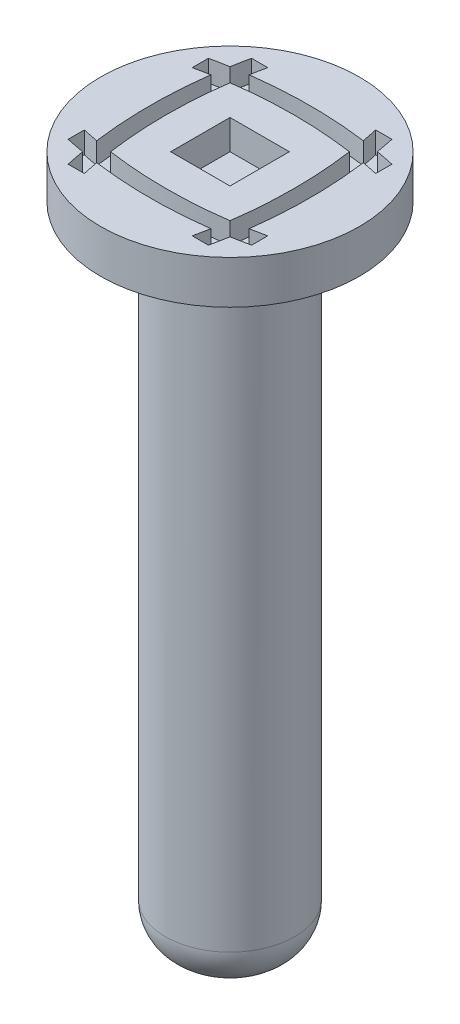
ISO-10303-21;
HEADER;
FILE_DESCRIPTION(('STEP AP214'),'2;1');
FILE_NAME('part.step','',(''),(''),'','','');
FILE_SCHEMA(('AUTOMOTIVE_DESIGN { 1 0 10303 214 1 1 1 1 }'));
ENDSEC;
DATA;
#1=APPLICATION_CONTEXT('core data for automotive mechanical design processes');
#2=APPLICATION_PROTOCOL_DEFINITION('international standard','automotive_design',2000,#1);
#3=PRODUCT_CONTEXT('',#1,'mechanical');
#4=PRODUCT('Part','Part','',(#3));
#5=PRODUCT_RELATED_PRODUCT_CATEGORY('part','',(#4));
#6=PRODUCT_DEFINITION_FORMATION('','',#4);
#7=PRODUCT_DEFINITION_CONTEXT('part definition',#1,'design');
#8=PRODUCT_DEFINITION('design','',#6,#7);
#9=PRODUCT_DEFINITION_SHAPE('','',#8);
#10=(LENGTH_UNIT() NAMED_UNIT(*) SI_UNIT(.MILLI.,.METRE.));
#11=(NAMED_UNIT(*) PLANE_ANGLE_UNIT() SI_UNIT($,.RADIAN.));
#12=(NAMED_UNIT(*) SI_UNIT($,.STERADIAN.) SOLID_ANGLE_UNIT());
#13=UNCERTAINTY_MEASURE_WITH_UNIT(LENGTH_MEASURE(1.E-05),#10,'distance_accuracy_value','');
#14=(GEOMETRIC_REPRESENTATION_CONTEXT(3) GLOBAL_UNCERTAINTY_ASSIGNED_CONTEXT((#13)) GLOBAL_UNIT_ASSIGNED_CONTEXT((#10,
#11,#12)) REPRESENTATION_CONTEXT('',''));
#15=CARTESIAN_POINT('',(0.,0.,0.));
#16=DIRECTION('',(0.,0.,1.));
#17=DIRECTION('',(1.,0.,0.));
#18=AXIS2_PLACEMENT_3D('',#15,#16,#17);
#19=CARTESIAN_POINT('',(0.,8.,0.));
#20=DIRECTION('',(0.,-1.,0.));
#21=DIRECTION('',(0.,0.,-1.));
#22=AXIS2_PLACEMENT_3D('',#19,#20,#21);
#23=CYLINDRICAL_SURFACE('',#22,24.);
#24=CARTESIAN_POINT('',(0.,8.,0.));
#25=DIRECTION('',(0.,1.,0.));
#26=DIRECTION('',(0.,0.,1.));
#27=AXIS2_PLACEMENT_3D('',#24,#25,#26);
#28=CIRCLE('',#27,24.);
#29=CARTESIAN_POINT('',(0.,8.,24.));
#30=VERTEX_POINT('',#29);
#31=EDGE_CURVE('E564',#30,#30,#28,.T.);
#32=ORIENTED_EDGE('',*,*,#31,.F.);
#33=EDGE_LOOP('',(#32));
#34=FACE_BOUND('',#33,.T.);
#35=CARTESIAN_POINT('',(0.,0.,0.));
#36=DIRECTION('',(0.,1.,0.));
#37=DIRECTION('',(0.,0.,1.));
#38=AXIS2_PLACEMENT_3D('',#35,#36,#37);
#39=CIRCLE('',#38,24.);
#40=CARTESIAN_POINT('',(0.,0.,24.));
#41=VERTEX_POINT('',#40);
#42=EDGE_CURVE('E557',#41,#41,#39,.T.);
#43=ORIENTED_EDGE('',*,*,#42,.T.);
#44=EDGE_LOOP('',(#43));
#45=FACE_BOUND('',#44,.T.);
#46=ADVANCED_FACE('F35',(#34,#45),#23,.T.);
#47=CARTESIAN_POINT('',(0.,8.,0.));
#48=DIRECTION('',(0.,1.,0.));
#49=DIRECTION('',(0.,0.,1.));
#50=AXIS2_PLACEMENT_3D('',#47,#48,#49);
#51=PLANE('',#50);
#52=CARTESIAN_POINT('',(0.,8.,65.1728853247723));
#53=DIRECTION('',(0.,1.,0.));
#54=DIRECTION('',(0.,0.,-1.));
#55=AXIS2_PLACEMENT_3D('',#52,#53,#54);
#56=CIRCLE('',#55,80.);
#57=CARTESIAN_POINT('',(-13.6534076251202,8.,-13.6534076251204));
#58=VERTEX_POINT('',#57);
#59=CARTESIAN_POINT('',(-17.,8.,-13.));
#60=VERTEX_POINT('',#59);
#61=EDGE_CURVE('E50',#58,#60,#56,.T.);
#62=ORIENTED_EDGE('',*,*,#61,.F.);
#63=CARTESIAN_POINT('',(65.1728853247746,8.,-3.61937451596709E-12));
#64=DIRECTION('',(0.,1.,0.));
#65=DIRECTION('',(0.,0.,-1.));
#66=AXIS2_PLACEMENT_3D('',#63,#64,#65);
#67=CIRCLE('',#66,80.0000000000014);
#68=CARTESIAN_POINT('',(-12.9999999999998,8.,-17.0000000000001));
#69=VERTEX_POINT('',#68);
#70=EDGE_CURVE('E313',#69,#58,#67,.T.);
#71=ORIENTED_EDGE('',*,*,#70,.F.);
#72=DIRECTION('',(-1.,0.,2.15105711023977E-13));
#73=VECTOR('',#72,1.);
#74=CARTESIAN_POINT('',(-10.0000000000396,8.,-17.0000000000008));
#75=LINE('',#74,#73);
#76=CARTESIAN_POINT('',(-10.0000000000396,8.,-17.0000000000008));
#77=VERTEX_POINT('',#76);
#78=EDGE_CURVE('E471',#77,#69,#75,.T.);
#79=ORIENTED_EDGE('',*,*,#78,.F.);
#80=CARTESIAN_POINT('',(67.4053186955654,8.,-9.76183332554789E-11));
#81=DIRECTION('',(0.,-1.,0.));
#82=DIRECTION('',(0.,0.,-1.));
#83=AXIS2_PLACEMENT_3D('',#80,#81,#82);
#84=CIRCLE('',#83,79.2501316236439);
#85=CARTESIAN_POINT('',(-10.5758870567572,8.,-14.1249747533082));
#86=VERTEX_POINT('',#85);
#87=EDGE_CURVE('E468',#86,#77,#84,.T.);
#88=ORIENTED_EDGE('',*,*,#87,.F.);
#89=CARTESIAN_POINT('',(0.,8.,65.1728853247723));
#90=DIRECTION('',(0.,1.,0.));
#91=DIRECTION('',(0.,0.,-1.));
#92=AXIS2_PLACEMENT_3D('',#89,#90,#91);
#93=CIRCLE('',#92,80.0000000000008);
#94=CARTESIAN_POINT('',(10.5758870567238,8.,-14.1249747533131));
#95=VERTEX_POINT('',#94);
#96=EDGE_CURVE('E465',#95,#86,#93,.T.);
#97=ORIENTED_EDGE('',*,*,#96,.F.);
#98=CARTESIAN_POINT('',(-67.4053186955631,8.,9.37728701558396E-11));
#99=DIRECTION('',(0.,-1.,0.));
#100=DIRECTION('',(0.,0.,-1.));
#101=AXIS2_PLACEMENT_3D('',#98,#99,#100);
#102=CIRCLE('',#101,79.2501316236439);
#103=CARTESIAN_POINT('',(10.0000000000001,8.,-17.));
#104=VERTEX_POINT('',#103);
#105=EDGE_CURVE('E462',#104,#95,#102,.T.);
#106=ORIENTED_EDGE('',*,*,#105,.F.);
#107=DIRECTION('',(-1.,0.,0.));
#108=VECTOR('',#107,1.);
#109=CARTESIAN_POINT('',(13.0000000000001,8.,-17.));
#110=LINE('',#109,#108);
#111=CARTESIAN_POINT('',(13.0000000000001,8.,-17.));
#112=VERTEX_POINT('',#111);
#113=EDGE_CURVE('E459',#112,#104,#110,.T.);
#114=ORIENTED_EDGE('',*,*,#113,.F.);
#115=CARTESIAN_POINT('',(-65.1728853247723,8.,-2.25815189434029E-13));
#116=DIRECTION('',(0.,1.,0.));
#117=DIRECTION('',(0.,0.,-1.));
#118=AXIS2_PLACEMENT_3D('',#115,#116,#117);
#119=CIRCLE('',#118,80.);
#120=CARTESIAN_POINT('',(13.6534076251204,8.,-13.6534076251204));
#121=VERTEX_POINT('',#120);
#122=EDGE_CURVE('E456',#121,#112,#119,.T.);
#123=ORIENTED_EDGE('',*,*,#122,.F.);
#124=CARTESIAN_POINT('',(0.,8.,65.1728853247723));
#125=DIRECTION('',(0.,1.,0.));
#126=DIRECTION('',(0.,0.,-1.));
#127=AXIS2_PLACEMENT_3D('',#124,#125,#126);
#128=CIRCLE('',#127,80.);
#129=CARTESIAN_POINT('',(17.,8.,-13.));
#130=VERTEX_POINT('',#129);
#131=EDGE_CURVE('E453',#130,#121,#128,.T.);
#132=ORIENTED_EDGE('',*,*,#131,.F.);
#133=DIRECTION('',(0.,0.,-1.));
#134=VECTOR('',#133,1.);
#135=CARTESIAN_POINT('',(17.,8.,-10.0000000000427));
#136=LINE('',#135,#134);
#137=CARTESIAN_POINT('',(17.,8.,-10.0000000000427));
#138=VERTEX_POINT('',#137);
#139=EDGE_CURVE('E450',#138,#130,#136,.T.);
#140=ORIENTED_EDGE('',*,*,#139,.F.);
#141=CARTESIAN_POINT('',(9.68253255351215E-11,8.,67.4053186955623));
#142=DIRECTION('',(0.,-1.,0.));
#143=DIRECTION('',(0.,0.,-1.));
#144=AXIS2_PLACEMENT_3D('',#141,#142,#143);
#145=CIRCLE('',#144,79.2501316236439);
#146=CARTESIAN_POINT('',(14.1249747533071,8.,-10.5758870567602));
#147=VERTEX_POINT('',#146);
#148=EDGE_CURVE('E447',#147,#138,#145,.T.);
#149=ORIENTED_EDGE('',*,*,#148,.F.);
#150=CARTESIAN_POINT('',(-65.1728853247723,8.,-2.25815189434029E-13));
#151=DIRECTION('',(0.,1.,0.));
#152=DIRECTION('',(0.,0.,-1.));
#153=AXIS2_PLACEMENT_3D('',#150,#151,#152);
#154=CIRCLE('',#153,80.);
#155=CARTESIAN_POINT('',(14.1249747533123,8.,10.5758870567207));
#156=VERTEX_POINT('',#155);
#157=EDGE_CURVE('E444',#156,#147,#154,.T.);
#158=ORIENTED_EDGE('',*,*,#157,.F.);
#159=CARTESIAN_POINT('',(-9.45576231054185E-11,8.,-67.4053186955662));
#160=DIRECTION('',(0.,-1.,0.));
#161=DIRECTION('',(0.,0.,-1.));
#162=AXIS2_PLACEMENT_3D('',#159,#160,#161);
#163=CIRCLE('',#162,79.2501316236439);
#164=CARTESIAN_POINT('',(17.0000000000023,8.,9.99999999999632));
#165=VERTEX_POINT('',#164);
#166=EDGE_CURVE('E441',#165,#156,#163,.T.);
#167=ORIENTED_EDGE('',*,*,#166,.F.);
#168=DIRECTION('',(0.,0.,-1.));
#169=VECTOR('',#168,1.);
#170=CARTESIAN_POINT('',(17.0000000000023,8.,12.9999999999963));
#171=LINE('',#170,#169);
#172=CARTESIAN_POINT('',(17.0000000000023,8.,12.9999999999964));
#173=VERTEX_POINT('',#172);
#174=EDGE_CURVE('E438',#173,#165,#171,.T.);
#175=ORIENTED_EDGE('',*,*,#174,.F.);
#176=CARTESIAN_POINT('',(4.53365102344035E-13,8.,-65.1728853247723));
#177=DIRECTION('',(0.,1.,0.));
#178=DIRECTION('',(0.,0.,-1.));
#179=AXIS2_PLACEMENT_3D('',#176,#177,#178);
#180=CIRCLE('',#179,79.9999999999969);
#181=CARTESIAN_POINT('',(13.6534076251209,8.,13.6534076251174));
#182=VERTEX_POINT('',#181);
#183=EDGE_CURVE('E435',#182,#173,#180,.T.);
#184=ORIENTED_EDGE('',*,*,#183,.F.);
#185=CARTESIAN_POINT('',(-65.1728853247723,8.,-2.25815189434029E-13));
#186=DIRECTION('',(0.,1.,0.));
#187=DIRECTION('',(0.,0.,-1.));
#188=AXIS2_PLACEMENT_3D('',#185,#186,#187);
#189=CIRCLE('',#188,80.);
#190=CARTESIAN_POINT('',(12.9999999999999,8.,17.));
#191=VERTEX_POINT('',#190);
#192=EDGE_CURVE('E432',#191,#182,#189,.T.);
#193=ORIENTED_EDGE('',*,*,#192,.F.);
#194=DIRECTION('',(1.,0.,1.0327387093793E-12));
#195=VECTOR('',#194,1.);
#196=CARTESIAN_POINT('',(10.0000000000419,8.,16.9999999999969));
#197=LINE('',#196,#195);
#198=CARTESIAN_POINT('',(10.0000000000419,8.,16.999999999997));
#199=VERTEX_POINT('',#198);
#200=EDGE_CURVE('E429',#199,#191,#197,.T.);
#201=ORIENTED_EDGE('',*,*,#200,.F.);
#202=CARTESIAN_POINT('',(-67.4053186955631,8.,9.37728701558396E-11));
#203=DIRECTION('',(0.,-1.,0.));
#204=DIRECTION('',(0.,0.,-1.));
#205=AXIS2_PLACEMENT_3D('',#202,#203,#204);
#206=CIRCLE('',#205,79.2501316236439);
#207=CARTESIAN_POINT('',(10.5758870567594,8.,14.1249747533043));
#208=VERTEX_POINT('',#207);
#209=EDGE_CURVE('E426',#208,#199,#206,.T.);
#210=ORIENTED_EDGE('',*,*,#209,.F.);
#211=CARTESIAN_POINT('',(4.53365102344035E-13,8.,-65.1728853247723));
#212=DIRECTION('',(0.,1.,0.));
#213=DIRECTION('',(0.,0.,-1.));
#214=AXIS2_PLACEMENT_3D('',#211,#212,#213);
#215=CIRCLE('',#214,79.9999999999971);
#216=CARTESIAN_POINT('',(-10.575887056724,8.,14.1249747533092));
#217=VERTEX_POINT('',#216);
#218=EDGE_CURVE('E423',#217,#208,#215,.T.);
#219=ORIENTED_EDGE('',*,*,#218,.F.);
#220=CARTESIAN_POINT('',(67.4053186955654,8.,-9.76183332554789E-11));
#221=DIRECTION('',(0.,-1.,0.));
#222=DIRECTION('',(0.,0.,-1.));
#223=AXIS2_PLACEMENT_3D('',#220,#221,#222);
#224=CIRCLE('',#223,79.2501316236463);
#225=CARTESIAN_POINT('',(-10.0000000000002,8.,16.9999999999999));
#226=VERTEX_POINT('',#225);
#227=EDGE_CURVE('E420',#226,#217,#224,.T.);
#228=ORIENTED_EDGE('',*,*,#227,.F.);
#229=DIRECTION('',(1.,0.,0.));
#230=VECTOR('',#229,1.);
#231=CARTESIAN_POINT('',(-13.0000000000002,8.,16.9999999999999));
#232=LINE('',#231,#230);
#233=CARTESIAN_POINT('',(-12.9999999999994,8.,16.9999999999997));
#234=VERTEX_POINT('',#233);
#235=EDGE_CURVE('E417',#234,#226,#232,.T.);
#236=ORIENTED_EDGE('',*,*,#235,.F.);
#237=CARTESIAN_POINT('',(65.1728853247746,8.,-3.61937451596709E-12));
#238=DIRECTION('',(0.,1.,0.));
#239=DIRECTION('',(0.,0.,-1.));
#240=AXIS2_PLACEMENT_3D('',#237,#238,#239);
#241=CIRCLE('',#240,80.0000000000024);
#242=CARTESIAN_POINT('',(-13.6534076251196,8.,13.6534076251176));
#243=VERTEX_POINT('',#242);
#244=EDGE_CURVE('E414',#243,#234,#241,.T.);
#245=ORIENTED_EDGE('',*,*,#244,.F.);
#246=CARTESIAN_POINT('',(4.53365102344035E-13,8.,-65.1728853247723));
#247=DIRECTION('',(0.,1.,0.));
#248=DIRECTION('',(0.,0.,-1.));
#249=AXIS2_PLACEMENT_3D('',#246,#247,#248);
#250=CIRCLE('',#249,79.9999999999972);
#251=CARTESIAN_POINT('',(-16.9999999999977,8.,12.9999999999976));
#252=VERTEX_POINT('',#251);
#253=EDGE_CURVE('E411',#252,#243,#250,.T.);
#254=ORIENTED_EDGE('',*,*,#253,.F.);
#255=DIRECTION('',(0.,0.,1.));
#256=VECTOR('',#255,1.);
#257=CARTESIAN_POINT('',(-16.9999999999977,8.,10.0000000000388));
#258=LINE('',#257,#256);
#259=CARTESIAN_POINT('',(-16.9999999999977,8.,10.0000000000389));
#260=VERTEX_POINT('',#259);
#261=EDGE_CURVE('E408',#260,#252,#258,.T.);
#262=ORIENTED_EDGE('',*,*,#261,.F.);
#263=CARTESIAN_POINT('',(-9.45576231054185E-11,8.,-67.4053186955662));
#264=DIRECTION('',(0.,-1.,0.));
#265=DIRECTION('',(0.,0.,-1.));
#266=AXIS2_PLACEMENT_3D('',#263,#264,#265);
#267=CIRCLE('',#266,79.2501316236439);
#268=CARTESIAN_POINT('',(-14.1249747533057,8.,10.575887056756));
#269=VERTEX_POINT('',#268);
#270=EDGE_CURVE('E405',#269,#260,#267,.T.);
#271=ORIENTED_EDGE('',*,*,#270,.F.);
#272=CARTESIAN_POINT('',(65.1728853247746,8.,-3.61937451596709E-12));
#273=DIRECTION('',(0.,1.,0.));
#274=DIRECTION('',(0.,0.,-1.));
#275=AXIS2_PLACEMENT_3D('',#272,#273,#274);
#276=CIRCLE('',#275,80.0000000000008);
#277=CARTESIAN_POINT('',(-14.12497475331,8.,-10.5758870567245));
#278=VERTEX_POINT('',#277);
#279=EDGE_CURVE('E402',#278,#269,#276,.T.);
#280=ORIENTED_EDGE('',*,*,#279,.F.);
#281=CARTESIAN_POINT('',(9.68253255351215E-11,8.,67.4053186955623));
#282=DIRECTION('',(0.,-1.,0.));
#283=DIRECTION('',(0.,0.,-1.));
#284=AXIS2_PLACEMENT_3D('',#281,#282,#283);
#285=CIRCLE('',#284,79.2501316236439);
#286=CARTESIAN_POINT('',(-17.,8.,-10.));
#287=VERTEX_POINT('',#286);
#288=EDGE_CURVE('E399',#287,#278,#285,.T.);
#289=ORIENTED_EDGE('',*,*,#288,.F.);
#290=DIRECTION('',(0.,0.,1.));
#291=VECTOR('',#290,1.);
#292=CARTESIAN_POINT('',(-17.,8.,-13.));
#293=LINE('',#292,#291);
#294=EDGE_CURVE('E396',#60,#287,#293,.T.);
#295=ORIENTED_EDGE('',*,*,#294,.F.);
#296=EDGE_LOOP('',(#62,#71,#79,#88,#97,#106,#114,#123,#132,#140,#149,#158,#167,#175,#184,#193,
#201,#210,#219,#228,#236,#245,#254,#262,#271,#280,#289,#295));
#297=FACE_BOUND('',#296,.T.);
#298=ORIENTED_EDGE('',*,*,#31,.T.);
#299=EDGE_LOOP('',(#298));
#300=FACE_BOUND('',#299,.T.);
#301=ADVANCED_FACE('F586',(#297,#300),#51,.T.);
#302=CARTESIAN_POINT('',(0.,0.,0.));
#303=DIRECTION('',(0.,1.,0.));
#304=DIRECTION('',(0.,0.,1.));
#305=AXIS2_PLACEMENT_3D('',#302,#303,#304);
#306=PLANE('',#305);
#307=CARTESIAN_POINT('',(0.,0.,0.));
#308=DIRECTION('',(0.,1.,0.));
#309=DIRECTION('',(0.,0.,1.));
#310=AXIS2_PLACEMENT_3D('',#307,#308,#309);
#311=CIRCLE('',#310,12.);
#312=CARTESIAN_POINT('',(0.,0.,12.));
#313=VERTEX_POINT('',#312);
#314=EDGE_CURVE('E567',#313,#313,#311,.F.);
#315=ORIENTED_EDGE('',*,*,#314,.F.);
#316=EDGE_LOOP('',(#315));
#317=FACE_BOUND('',#316,.T.);
#318=ORIENTED_EDGE('',*,*,#42,.F.);
#319=EDGE_LOOP('',(#318));
#320=FACE_BOUND('',#319,.T.);
#321=ADVANCED_FACE('F591',(#317,#320),#306,.F.);
#322=CARTESIAN_POINT('',(0.,4.,65.1728853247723));
#323=DIRECTION('',(0.,1.,0.));
#324=DIRECTION('',(0.,0.,1.));
#325=AXIS2_PLACEMENT_3D('',#322,#323,#324);
#326=CYLINDRICAL_SURFACE('',#325,80.);
#327=ORIENTED_EDGE('',*,*,#61,.T.);
#328=DIRECTION('',(0.,1.,0.));
#329=VECTOR('',#328,1.);
#330=CARTESIAN_POINT('',(-17.,4.,-13.));
#331=LINE('',#330,#329);
#332=CARTESIAN_POINT('',(-17.,4.,-13.));
#333=VERTEX_POINT('',#332);
#334=EDGE_CURVE('E394',#333,#60,#331,.T.);
#335=ORIENTED_EDGE('',*,*,#334,.F.);
#336=CARTESIAN_POINT('',(0.,4.,65.1728853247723));
#337=DIRECTION('',(0.,1.,0.));
#338=DIRECTION('',(0.,0.,-1.));
#339=AXIS2_PLACEMENT_3D('',#336,#337,#338);
#340=CIRCLE('',#339,80.);
#341=CARTESIAN_POINT('',(-13.6534076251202,4.,-13.6534076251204));
#342=VERTEX_POINT('',#341);
#343=EDGE_CURVE('E309',#342,#333,#340,.T.);
#344=ORIENTED_EDGE('',*,*,#343,.F.);
#345=DIRECTION('',(0.,1.,0.));
#346=VECTOR('',#345,1.);
#347=CARTESIAN_POINT('',(-13.6534076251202,4.,-13.6534076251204));
#348=LINE('',#347,#346);
#349=EDGE_CURVE('E476',#342,#58,#348,.T.);
#350=ORIENTED_EDGE('',*,*,#349,.T.);
#351=EDGE_LOOP('',(#327,#335,#344,#350));
#352=FACE_BOUND('',#351,.T.);
#353=ADVANCED_FACE('F599',(#352),#326,.F.);
#354=CARTESIAN_POINT('',(65.1728853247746,4.,-3.61937451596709E-12));
#355=DIRECTION('',(0.,1.,0.));
#356=DIRECTION('',(0.,0.,1.));
#357=AXIS2_PLACEMENT_3D('',#354,#355,#356);
#358=CYLINDRICAL_SURFACE('',#357,80.0000000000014);
#359=ORIENTED_EDGE('',*,*,#70,.T.);
#360=ORIENTED_EDGE('',*,*,#349,.F.);
#361=CARTESIAN_POINT('',(65.1728853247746,4.,-3.61937451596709E-12));
#362=DIRECTION('',(0.,1.,0.));
#363=DIRECTION('',(0.,0.,-1.));
#364=AXIS2_PLACEMENT_3D('',#361,#362,#363);
#365=CIRCLE('',#364,80.0000000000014);
#366=CARTESIAN_POINT('',(-12.9999999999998,4.,-17.0000000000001));
#367=VERTEX_POINT('',#366);
#368=EDGE_CURVE('E391',#367,#342,#365,.T.);
#369=ORIENTED_EDGE('',*,*,#368,.F.);
#370=DIRECTION('',(0.,1.,0.));
#371=VECTOR('',#370,1.);
#372=CARTESIAN_POINT('',(-12.9999999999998,4.,-17.0000000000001));
#373=LINE('',#372,#371);
#374=EDGE_CURVE('E479',#367,#69,#373,.T.);
#375=ORIENTED_EDGE('',*,*,#374,.T.);
#376=EDGE_LOOP('',(#359,#360,#369,#375));
#377=FACE_BOUND('',#376,.T.);
#378=ADVANCED_FACE('F624',(#377),#358,.F.);
#379=CARTESIAN_POINT('',(-10.0000000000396,4.,-17.0000000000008));
#380=DIRECTION('',(-2.15105711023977E-13,0.,-1.));
#381=DIRECTION('',(-1.,0.,2.15105711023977E-13));
#382=AXIS2_PLACEMENT_3D('',#379,#380,#381);
#383=PLANE('',#382);
#384=ORIENTED_EDGE('',*,*,#78,.T.);
#385=ORIENTED_EDGE('',*,*,#374,.F.);
#386=DIRECTION('',(-1.,0.,2.15105711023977E-13));
#387=VECTOR('',#386,1.);
#388=CARTESIAN_POINT('',(-10.0000000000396,4.,-17.0000000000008));
#389=LINE('',#388,#387);
#390=CARTESIAN_POINT('',(-10.0000000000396,4.,-17.0000000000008));
#391=VERTEX_POINT('',#390);
#392=EDGE_CURVE('E388',#391,#367,#389,.T.);
#393=ORIENTED_EDGE('',*,*,#392,.F.);
#394=DIRECTION('',(0.,1.,0.));
#395=VECTOR('',#394,1.);
#396=CARTESIAN_POINT('',(-10.0000000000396,4.,-17.0000000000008));
#397=LINE('',#396,#395);
#398=EDGE_CURVE('E481',#391,#77,#397,.T.);
#399=ORIENTED_EDGE('',*,*,#398,.T.);
#400=EDGE_LOOP('',(#384,#385,#393,#399));
#401=FACE_BOUND('',#400,.T.);
#402=ADVANCED_FACE('F724',(#401),#383,.F.);
#403=CARTESIAN_POINT('',(67.4053186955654,4.,-9.76183332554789E-11));
#404=DIRECTION('',(0.,1.,0.));
#405=DIRECTION('',(0.,0.,1.));
#406=AXIS2_PLACEMENT_3D('',#403,#404,#405);
#407=CYLINDRICAL_SURFACE('',#406,79.2501316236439);
#408=ORIENTED_EDGE('',*,*,#87,.T.);
#409=ORIENTED_EDGE('',*,*,#398,.F.);
#410=CARTESIAN_POINT('',(67.4053186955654,4.,-9.76183332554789E-11));
#411=DIRECTION('',(0.,-1.,0.));
#412=DIRECTION('',(0.,0.,-1.));
#413=AXIS2_PLACEMENT_3D('',#410,#411,#412);
#414=CIRCLE('',#413,79.2501316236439);
#415=CARTESIAN_POINT('',(-10.5758870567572,4.,-14.1249747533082));
#416=VERTEX_POINT('',#415);
#417=EDGE_CURVE('E385',#416,#391,#414,.T.);
#418=ORIENTED_EDGE('',*,*,#417,.F.);
#419=DIRECTION('',(0.,1.,0.));
#420=VECTOR('',#419,1.);
#421=CARTESIAN_POINT('',(-10.5758870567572,4.,-14.1249747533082));
#422=LINE('',#421,#420);
#423=EDGE_CURVE('E483',#416,#86,#422,.T.);
#424=ORIENTED_EDGE('',*,*,#423,.T.);
#425=EDGE_LOOP('',(#408,#409,#418,#424));
#426=FACE_BOUND('',#425,.T.);
#427=ADVANCED_FACE('F720',(#426),#407,.T.);
#428=CARTESIAN_POINT('',(0.,4.,65.1728853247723));
#429=DIRECTION('',(0.,1.,0.));
#430=DIRECTION('',(0.,0.,1.));
#431=AXIS2_PLACEMENT_3D('',#428,#429,#430);
#432=CYLINDRICAL_SURFACE('',#431,80.0000000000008);
#433=ORIENTED_EDGE('',*,*,#96,.T.);
#434=ORIENTED_EDGE('',*,*,#423,.F.);
#435=CARTESIAN_POINT('',(0.,4.,65.1728853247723));
#436=DIRECTION('',(0.,1.,0.));
#437=DIRECTION('',(0.,0.,-1.));
#438=AXIS2_PLACEMENT_3D('',#435,#436,#437);
#439=CIRCLE('',#438,80.0000000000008);
#440=CARTESIAN_POINT('',(10.5758870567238,4.,-14.1249747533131));
#441=VERTEX_POINT('',#440);
#442=EDGE_CURVE('E382',#441,#416,#439,.T.);
#443=ORIENTED_EDGE('',*,*,#442,.F.);
#444=DIRECTION('',(0.,1.,0.));
#445=VECTOR('',#444,1.);
#446=CARTESIAN_POINT('',(10.5758870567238,4.,-14.1249747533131));
#447=LINE('',#446,#445);
#448=EDGE_CURVE('E485',#441,#95,#447,.T.);
#449=ORIENTED_EDGE('',*,*,#448,.T.);
#450=EDGE_LOOP('',(#433,#434,#443,#449));
#451=FACE_BOUND('',#450,.T.);
#452=ADVANCED_FACE('F716',(#451),#432,.F.);
#453=CARTESIAN_POINT('',(-67.4053186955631,4.,9.37728701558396E-11));
#454=DIRECTION('',(0.,1.,0.));
#455=DIRECTION('',(0.,0.,1.));
#456=AXIS2_PLACEMENT_3D('',#453,#454,#455);
#457=CYLINDRICAL_SURFACE('',#456,79.2501316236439);
#458=ORIENTED_EDGE('',*,*,#105,.T.);
#459=ORIENTED_EDGE('',*,*,#448,.F.);
#460=CARTESIAN_POINT('',(-67.4053186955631,4.,9.37728701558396E-11));
#461=DIRECTION('',(0.,-1.,0.));
#462=DIRECTION('',(0.,0.,-1.));
#463=AXIS2_PLACEMENT_3D('',#460,#461,#462);
#464=CIRCLE('',#463,79.2501316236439);
#465=CARTESIAN_POINT('',(10.0000000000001,4.,-17.));
#466=VERTEX_POINT('',#465);
#467=EDGE_CURVE('E379',#466,#441,#464,.T.);
#468=ORIENTED_EDGE('',*,*,#467,.F.);
#469=DIRECTION('',(0.,1.,0.));
#470=VECTOR('',#469,1.);
#471=CARTESIAN_POINT('',(10.0000000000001,4.,-17.));
#472=LINE('',#471,#470);
#473=EDGE_CURVE('E487',#466,#104,#472,.T.);
#474=ORIENTED_EDGE('',*,*,#473,.T.);
#475=EDGE_LOOP('',(#458,#459,#468,#474));
#476=FACE_BOUND('',#475,.T.);
#477=ADVANCED_FACE('F712',(#476),#457,.T.);
#478=CARTESIAN_POINT('',(13.0000000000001,4.,-17.));
#479=DIRECTION('',(0.,0.,-1.));
#480=DIRECTION('',(-1.,0.,0.));
#481=AXIS2_PLACEMENT_3D('',#478,#479,#480);
#482=PLANE('',#481);
#483=ORIENTED_EDGE('',*,*,#113,.T.);
#484=ORIENTED_EDGE('',*,*,#473,.F.);
#485=DIRECTION('',(-1.,0.,0.));
#486=VECTOR('',#485,1.);
#487=CARTESIAN_POINT('',(13.0000000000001,4.,-17.));
#488=LINE('',#487,#486);
#489=CARTESIAN_POINT('',(13.0000000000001,4.,-17.));
#490=VERTEX_POINT('',#489);
#491=EDGE_CURVE('E376',#490,#466,#488,.T.);
#492=ORIENTED_EDGE('',*,*,#491,.F.);
#493=DIRECTION('',(0.,1.,0.));
#494=VECTOR('',#493,1.);
#495=CARTESIAN_POINT('',(13.0000000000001,4.,-17.));
#496=LINE('',#495,#494);
#497=EDGE_CURVE('E489',#490,#112,#496,.T.);
#498=ORIENTED_EDGE('',*,*,#497,.T.);
#499=EDGE_LOOP('',(#483,#484,#492,#498));
#500=FACE_BOUND('',#499,.T.);
#501=ADVANCED_FACE('F708',(#500),#482,.F.);
#502=CARTESIAN_POINT('',(-65.1728853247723,4.,-2.25815189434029E-13));
#503=DIRECTION('',(0.,1.,0.));
#504=DIRECTION('',(0.,0.,1.));
#505=AXIS2_PLACEMENT_3D('',#502,#503,#504);
#506=CYLINDRICAL_SURFACE('',#505,80.);
#507=ORIENTED_EDGE('',*,*,#122,.T.);
#508=ORIENTED_EDGE('',*,*,#497,.F.);
#509=CARTESIAN_POINT('',(-65.1728853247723,4.,-2.25815189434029E-13));
#510=DIRECTION('',(0.,1.,0.));
#511=DIRECTION('',(0.,0.,-1.));
#512=AXIS2_PLACEMENT_3D('',#509,#510,#511);
#513=CIRCLE('',#512,80.);
#514=CARTESIAN_POINT('',(13.6534076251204,4.,-13.6534076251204));
#515=VERTEX_POINT('',#514);
#516=EDGE_CURVE('E373',#515,#490,#513,.T.);
#517=ORIENTED_EDGE('',*,*,#516,.F.);
#518=DIRECTION('',(0.,1.,0.));
#519=VECTOR('',#518,1.);
#520=CARTESIAN_POINT('',(13.6534076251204,4.,-13.6534076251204));
#521=LINE('',#520,#519);
#522=EDGE_CURVE('E491',#515,#121,#521,.T.);
#523=ORIENTED_EDGE('',*,*,#522,.T.);
#524=EDGE_LOOP('',(#507,#508,#517,#523));
#525=FACE_BOUND('',#524,.T.);
#526=ADVANCED_FACE('F704',(#525),#506,.F.);
#527=CARTESIAN_POINT('',(0.,4.,65.1728853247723));
#528=DIRECTION('',(0.,1.,0.));
#529=DIRECTION('',(0.,0.,1.));
#530=AXIS2_PLACEMENT_3D('',#527,#528,#529);
#531=CYLINDRICAL_SURFACE('',#530,80.);
#532=ORIENTED_EDGE('',*,*,#131,.T.);
#533=ORIENTED_EDGE('',*,*,#522,.F.);
#534=CARTESIAN_POINT('',(0.,4.,65.1728853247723));
#535=DIRECTION('',(0.,1.,0.));
#536=DIRECTION('',(0.,0.,-1.));
#537=AXIS2_PLACEMENT_3D('',#534,#535,#536);
#538=CIRCLE('',#537,80.);
#539=CARTESIAN_POINT('',(17.,4.,-13.));
#540=VERTEX_POINT('',#539);
#541=EDGE_CURVE('E370',#540,#515,#538,.T.);
#542=ORIENTED_EDGE('',*,*,#541,.F.);
#543=DIRECTION('',(0.,1.,0.));
#544=VECTOR('',#543,1.);
#545=CARTESIAN_POINT('',(17.,4.,-13.));
#546=LINE('',#545,#544);
#547=EDGE_CURVE('E493',#540,#130,#546,.T.);
#548=ORIENTED_EDGE('',*,*,#547,.T.);
#549=EDGE_LOOP('',(#532,#533,#542,#548));
#550=FACE_BOUND('',#549,.T.);
#551=ADVANCED_FACE('F700',(#550),#531,.F.);
#552=CARTESIAN_POINT('',(17.,4.,-10.0000000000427));
#553=DIRECTION('',(1.,0.,0.));
#554=DIRECTION('',(0.,0.,-1.));
#555=AXIS2_PLACEMENT_3D('',#552,#553,#554);
#556=PLANE('',#555);
#557=ORIENTED_EDGE('',*,*,#139,.T.);
#558=ORIENTED_EDGE('',*,*,#547,.F.);
#559=DIRECTION('',(0.,0.,-1.));
#560=VECTOR('',#559,1.);
#561=CARTESIAN_POINT('',(17.,4.,-10.0000000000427));
#562=LINE('',#561,#560);
#563=CARTESIAN_POINT('',(17.,4.,-10.0000000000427));
#564=VERTEX_POINT('',#563);
#565=EDGE_CURVE('E367',#564,#540,#562,.T.);
#566=ORIENTED_EDGE('',*,*,#565,.F.);
#567=DIRECTION('',(0.,1.,0.));
#568=VECTOR('',#567,1.);
#569=CARTESIAN_POINT('',(17.,4.,-10.0000000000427));
#570=LINE('',#569,#568);
#571=EDGE_CURVE('E495',#564,#138,#570,.T.);
#572=ORIENTED_EDGE('',*,*,#571,.T.);
#573=EDGE_LOOP('',(#557,#558,#566,#572));
#574=FACE_BOUND('',#573,.T.);
#575=ADVANCED_FACE('F696',(#574),#556,.F.);
#576=CARTESIAN_POINT('',(9.68253255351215E-11,4.,67.4053186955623));
#577=DIRECTION('',(0.,1.,0.));
#578=DIRECTION('',(0.,0.,1.));
#579=AXIS2_PLACEMENT_3D('',#576,#577,#578);
#580=CYLINDRICAL_SURFACE('',#579,79.2501316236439);
#581=ORIENTED_EDGE('',*,*,#148,.T.);
#582=ORIENTED_EDGE('',*,*,#571,.F.);
#583=CARTESIAN_POINT('',(9.68253255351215E-11,4.,67.4053186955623));
#584=DIRECTION('',(0.,-1.,0.));
#585=DIRECTION('',(0.,0.,-1.));
#586=AXIS2_PLACEMENT_3D('',#583,#584,#585);
#587=CIRCLE('',#586,79.2501316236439);
#588=CARTESIAN_POINT('',(14.1249747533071,4.,-10.5758870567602));
#589=VERTEX_POINT('',#588);
#590=EDGE_CURVE('E364',#589,#564,#587,.T.);
#591=ORIENTED_EDGE('',*,*,#590,.F.);
#592=DIRECTION('',(0.,1.,0.));
#593=VECTOR('',#592,1.);
#594=CARTESIAN_POINT('',(14.1249747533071,4.,-10.5758870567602));
#595=LINE('',#594,#593);
#596=EDGE_CURVE('E497',#589,#147,#595,.T.);
#597=ORIENTED_EDGE('',*,*,#596,.T.);
#598=EDGE_LOOP('',(#581,#582,#591,#597));
#599=FACE_BOUND('',#598,.T.);
#600=ADVANCED_FACE('F692',(#599),#580,.T.);
#601=CARTESIAN_POINT('',(-65.1728853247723,4.,-2.25815189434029E-13));
#602=DIRECTION('',(0.,1.,0.));
#603=DIRECTION('',(0.,0.,1.));
#604=AXIS2_PLACEMENT_3D('',#601,#602,#603);
#605=CYLINDRICAL_SURFACE('',#604,80.);
#606=ORIENTED_EDGE('',*,*,#157,.T.);
#607=ORIENTED_EDGE('',*,*,#596,.F.);
#608=CARTESIAN_POINT('',(-65.1728853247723,4.,-2.25815189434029E-13));
#609=DIRECTION('',(0.,1.,0.));
#610=DIRECTION('',(0.,0.,-1.));
#611=AXIS2_PLACEMENT_3D('',#608,#609,#610);
#612=CIRCLE('',#611,80.);
#613=CARTESIAN_POINT('',(14.1249747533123,4.,10.5758870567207));
#614=VERTEX_POINT('',#613);
#615=EDGE_CURVE('E361',#614,#589,#612,.T.);
#616=ORIENTED_EDGE('',*,*,#615,.F.);
#617=DIRECTION('',(0.,1.,0.));
#618=VECTOR('',#617,1.);
#619=CARTESIAN_POINT('',(14.1249747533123,4.,10.5758870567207));
#620=LINE('',#619,#618);
#621=EDGE_CURVE('E499',#614,#156,#620,.T.);
#622=ORIENTED_EDGE('',*,*,#621,.T.);
#623=EDGE_LOOP('',(#606,#607,#616,#622));
#624=FACE_BOUND('',#623,.T.);
#625=ADVANCED_FACE('F688',(#624),#605,.F.);
#626=CARTESIAN_POINT('',(-9.45576231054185E-11,4.,-67.4053186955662));
#627=DIRECTION('',(0.,1.,0.));
#628=DIRECTION('',(0.,0.,1.));
#629=AXIS2_PLACEMENT_3D('',#626,#627,#628);
#630=CYLINDRICAL_SURFACE('',#629,79.2501316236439);
#631=ORIENTED_EDGE('',*,*,#166,.T.);
#632=ORIENTED_EDGE('',*,*,#621,.F.);
#633=CARTESIAN_POINT('',(-9.45576231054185E-11,4.,-67.4053186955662));
#634=DIRECTION('',(0.,-1.,0.));
#635=DIRECTION('',(0.,0.,-1.));
#636=AXIS2_PLACEMENT_3D('',#633,#634,#635);
#637=CIRCLE('',#636,79.2501316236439);
#638=CARTESIAN_POINT('',(17.0000000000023,4.,9.99999999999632));
#639=VERTEX_POINT('',#638);
#640=EDGE_CURVE('E358',#639,#614,#637,.T.);
#641=ORIENTED_EDGE('',*,*,#640,.F.);
#642=DIRECTION('',(0.,1.,0.));
#643=VECTOR('',#642,1.);
#644=CARTESIAN_POINT('',(17.0000000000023,4.,9.99999999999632));
#645=LINE('',#644,#643);
#646=EDGE_CURVE('E501',#639,#165,#645,.T.);
#647=ORIENTED_EDGE('',*,*,#646,.T.);
#648=EDGE_LOOP('',(#631,#632,#641,#647));
#649=FACE_BOUND('',#648,.T.);
#650=ADVANCED_FACE('F684',(#649),#630,.T.);
#651=CARTESIAN_POINT('',(17.0000000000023,4.,12.9999999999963));
#652=DIRECTION('',(1.,0.,0.));
#653=DIRECTION('',(0.,0.,-1.));
#654=AXIS2_PLACEMENT_3D('',#651,#652,#653);
#655=PLANE('',#654);
#656=ORIENTED_EDGE('',*,*,#174,.T.);
#657=ORIENTED_EDGE('',*,*,#646,.F.);
#658=DIRECTION('',(0.,0.,-1.));
#659=VECTOR('',#658,1.);
#660=CARTESIAN_POINT('',(17.0000000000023,4.,12.9999999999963));
#661=LINE('',#660,#659);
#662=CARTESIAN_POINT('',(17.0000000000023,4.,12.9999999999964));
#663=VERTEX_POINT('',#662);
#664=EDGE_CURVE('E355',#663,#639,#661,.T.);
#665=ORIENTED_EDGE('',*,*,#664,.F.);
#666=DIRECTION('',(0.,1.,0.));
#667=VECTOR('',#666,1.);
#668=CARTESIAN_POINT('',(17.0000000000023,4.,12.9999999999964));
#669=LINE('',#668,#667);
#670=EDGE_CURVE('E503',#663,#173,#669,.T.);
#671=ORIENTED_EDGE('',*,*,#670,.T.);
#672=EDGE_LOOP('',(#656,#657,#665,#671));
#673=FACE_BOUND('',#672,.T.);
#674=ADVANCED_FACE('F680',(#673),#655,.F.);
#675=CARTESIAN_POINT('',(4.53365102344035E-13,4.,-65.1728853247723));
#676=DIRECTION('',(0.,1.,0.));
#677=DIRECTION('',(0.,0.,1.));
#678=AXIS2_PLACEMENT_3D('',#675,#676,#677);
#679=CYLINDRICAL_SURFACE('',#678,79.9999999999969);
#680=ORIENTED_EDGE('',*,*,#183,.T.);
#681=ORIENTED_EDGE('',*,*,#670,.F.);
#682=CARTESIAN_POINT('',(4.53365102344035E-13,4.,-65.1728853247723));
#683=DIRECTION('',(0.,1.,0.));
#684=DIRECTION('',(0.,0.,-1.));
#685=AXIS2_PLACEMENT_3D('',#682,#683,#684);
#686=CIRCLE('',#685,79.9999999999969);
#687=CARTESIAN_POINT('',(13.6534076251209,4.,13.6534076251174));
#688=VERTEX_POINT('',#687);
#689=EDGE_CURVE('E352',#688,#663,#686,.T.);
#690=ORIENTED_EDGE('',*,*,#689,.F.);
#691=DIRECTION('',(0.,1.,0.));
#692=VECTOR('',#691,1.);
#693=CARTESIAN_POINT('',(13.6534076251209,4.,13.6534076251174));
#694=LINE('',#693,#692);
#695=EDGE_CURVE('E505',#688,#182,#694,.T.);
#696=ORIENTED_EDGE('',*,*,#695,.T.);
#697=EDGE_LOOP('',(#680,#681,#690,#696));
#698=FACE_BOUND('',#697,.T.);
#699=ADVANCED_FACE('F676',(#698),#679,.F.);
#700=CARTESIAN_POINT('',(-65.1728853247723,4.,-2.25815189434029E-13));
#701=DIRECTION('',(0.,1.,0.));
#702=DIRECTION('',(0.,0.,1.));
#703=AXIS2_PLACEMENT_3D('',#700,#701,#702);
#704=CYLINDRICAL_SURFACE('',#703,80.);
#705=ORIENTED_EDGE('',*,*,#192,.T.);
#706=ORIENTED_EDGE('',*,*,#695,.F.);
#707=CARTESIAN_POINT('',(-65.1728853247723,4.,-2.25815189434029E-13));
#708=DIRECTION('',(0.,1.,0.));
#709=DIRECTION('',(0.,0.,-1.));
#710=AXIS2_PLACEMENT_3D('',#707,#708,#709);
#711=CIRCLE('',#710,80.);
#712=CARTESIAN_POINT('',(12.9999999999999,4.,17.));
#713=VERTEX_POINT('',#712);
#714=EDGE_CURVE('E349',#713,#688,#711,.T.);
#715=ORIENTED_EDGE('',*,*,#714,.F.);
#716=DIRECTION('',(0.,1.,0.));
#717=VECTOR('',#716,1.);
#718=CARTESIAN_POINT('',(12.9999999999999,4.,17.));
#719=LINE('',#718,#717);
#720=EDGE_CURVE('E507',#713,#191,#719,.T.);
#721=ORIENTED_EDGE('',*,*,#720,.T.);
#722=EDGE_LOOP('',(#705,#706,#715,#721));
#723=FACE_BOUND('',#722,.T.);
#724=ADVANCED_FACE('F672',(#723),#704,.F.);
#725=CARTESIAN_POINT('',(10.0000000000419,4.,16.9999999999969));
#726=DIRECTION('',(-1.0327387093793E-12,0.,1.));
#727=DIRECTION('',(1.,0.,1.0327387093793E-12));
#728=AXIS2_PLACEMENT_3D('',#725,#726,#727);
#729=PLANE('',#728);
#730=ORIENTED_EDGE('',*,*,#200,.T.);
#731=ORIENTED_EDGE('',*,*,#720,.F.);
#732=DIRECTION('',(1.,0.,1.0327387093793E-12));
#733=VECTOR('',#732,1.);
#734=CARTESIAN_POINT('',(10.0000000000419,4.,16.9999999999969));
#735=LINE('',#734,#733);
#736=CARTESIAN_POINT('',(10.0000000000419,4.,16.999999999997));
#737=VERTEX_POINT('',#736);
#738=EDGE_CURVE('E346',#737,#713,#735,.T.);
#739=ORIENTED_EDGE('',*,*,#738,.F.);
#740=DIRECTION('',(0.,1.,0.));
#741=VECTOR('',#740,1.);
#742=CARTESIAN_POINT('',(10.0000000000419,4.,16.999999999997));
#743=LINE('',#742,#741);
#744=EDGE_CURVE('E509',#737,#199,#743,.T.);
#745=ORIENTED_EDGE('',*,*,#744,.T.);
#746=EDGE_LOOP('',(#730,#731,#739,#745));
#747=FACE_BOUND('',#746,.T.);
#748=ADVANCED_FACE('F668',(#747),#729,.F.);
#749=CARTESIAN_POINT('',(-67.4053186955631,4.,9.37728701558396E-11));
#750=DIRECTION('',(0.,1.,0.));
#751=DIRECTION('',(0.,0.,1.));
#752=AXIS2_PLACEMENT_3D('',#749,#750,#751);
#753=CYLINDRICAL_SURFACE('',#752,79.2501316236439);
#754=ORIENTED_EDGE('',*,*,#209,.T.);
#755=ORIENTED_EDGE('',*,*,#744,.F.);
#756=CARTESIAN_POINT('',(-67.4053186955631,4.,9.37728701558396E-11));
#757=DIRECTION('',(0.,-1.,0.));
#758=DIRECTION('',(0.,0.,-1.));
#759=AXIS2_PLACEMENT_3D('',#756,#757,#758);
#760=CIRCLE('',#759,79.2501316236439);
#761=CARTESIAN_POINT('',(10.5758870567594,4.,14.1249747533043));
#762=VERTEX_POINT('',#761);
#763=EDGE_CURVE('E343',#762,#737,#760,.T.);
#764=ORIENTED_EDGE('',*,*,#763,.F.);
#765=DIRECTION('',(0.,1.,0.));
#766=VECTOR('',#765,1.);
#767=CARTESIAN_POINT('',(10.5758870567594,4.,14.1249747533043));
#768=LINE('',#767,#766);
#769=EDGE_CURVE('E511',#762,#208,#768,.T.);
#770=ORIENTED_EDGE('',*,*,#769,.T.);
#771=EDGE_LOOP('',(#754,#755,#764,#770));
#772=FACE_BOUND('',#771,.T.);
#773=ADVANCED_FACE('F664',(#772),#753,.T.);
#774=CARTESIAN_POINT('',(4.53365102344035E-13,4.,-65.1728853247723));
#775=DIRECTION('',(0.,1.,0.));
#776=DIRECTION('',(0.,0.,1.));
#777=AXIS2_PLACEMENT_3D('',#774,#775,#776);
#778=CYLINDRICAL_SURFACE('',#777,79.9999999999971);
#779=ORIENTED_EDGE('',*,*,#218,.T.);
#780=ORIENTED_EDGE('',*,*,#769,.F.);
#781=CARTESIAN_POINT('',(4.53365102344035E-13,4.,-65.1728853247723));
#782=DIRECTION('',(0.,1.,0.));
#783=DIRECTION('',(0.,0.,-1.));
#784=AXIS2_PLACEMENT_3D('',#781,#782,#783);
#785=CIRCLE('',#784,79.9999999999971);
#786=CARTESIAN_POINT('',(-10.575887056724,4.,14.1249747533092));
#787=VERTEX_POINT('',#786);
#788=EDGE_CURVE('E340',#787,#762,#785,.T.);
#789=ORIENTED_EDGE('',*,*,#788,.F.);
#790=DIRECTION('',(0.,1.,0.));
#791=VECTOR('',#790,1.);
#792=CARTESIAN_POINT('',(-10.575887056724,4.,14.1249747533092));
#793=LINE('',#792,#791);
#794=EDGE_CURVE('E513',#787,#217,#793,.T.);
#795=ORIENTED_EDGE('',*,*,#794,.T.);
#796=EDGE_LOOP('',(#779,#780,#789,#795));
#797=FACE_BOUND('',#796,.T.);
#798=ADVANCED_FACE('F660',(#797),#778,.F.);
#799=CARTESIAN_POINT('',(67.4053186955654,4.,-9.76183332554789E-11));
#800=DIRECTION('',(0.,1.,0.));
#801=DIRECTION('',(0.,0.,1.));
#802=AXIS2_PLACEMENT_3D('',#799,#800,#801);
#803=CYLINDRICAL_SURFACE('',#802,79.2501316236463);
#804=ORIENTED_EDGE('',*,*,#227,.T.);
#805=ORIENTED_EDGE('',*,*,#794,.F.);
#806=CARTESIAN_POINT('',(67.4053186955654,4.,-9.76183332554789E-11));
#807=DIRECTION('',(0.,-1.,0.));
#808=DIRECTION('',(0.,0.,-1.));
#809=AXIS2_PLACEMENT_3D('',#806,#807,#808);
#810=CIRCLE('',#809,79.2501316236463);
#811=CARTESIAN_POINT('',(-10.0000000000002,4.,16.9999999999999));
#812=VERTEX_POINT('',#811);
#813=EDGE_CURVE('E337',#812,#787,#810,.T.);
#814=ORIENTED_EDGE('',*,*,#813,.F.);
#815=DIRECTION('',(0.,1.,0.));
#816=VECTOR('',#815,1.);
#817=CARTESIAN_POINT('',(-10.0000000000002,4.,16.9999999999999));
#818=LINE('',#817,#816);
#819=EDGE_CURVE('E515',#812,#226,#818,.T.);
#820=ORIENTED_EDGE('',*,*,#819,.T.);
#821=EDGE_LOOP('',(#804,#805,#814,#820));
#822=FACE_BOUND('',#821,.T.);
#823=ADVANCED_FACE('F656',(#822),#803,.T.);
#824=CARTESIAN_POINT('',(-13.0000000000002,4.,16.9999999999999));
#825=DIRECTION('',(0.,0.,1.));
#826=DIRECTION('',(1.,0.,0.));
#827=AXIS2_PLACEMENT_3D('',#824,#825,#826);
#828=PLANE('',#827);
#829=ORIENTED_EDGE('',*,*,#235,.T.);
#830=ORIENTED_EDGE('',*,*,#819,.F.);
#831=DIRECTION('',(1.,0.,0.));
#832=VECTOR('',#831,1.);
#833=CARTESIAN_POINT('',(-13.0000000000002,4.,16.9999999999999));
#834=LINE('',#833,#832);
#835=CARTESIAN_POINT('',(-12.9999999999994,4.,16.9999999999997));
#836=VERTEX_POINT('',#835);
#837=EDGE_CURVE('E334',#836,#812,#834,.T.);
#838=ORIENTED_EDGE('',*,*,#837,.F.);
#839=DIRECTION('',(0.,1.,0.));
#840=VECTOR('',#839,1.);
#841=CARTESIAN_POINT('',(-12.9999999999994,4.,16.9999999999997));
#842=LINE('',#841,#840);
#843=EDGE_CURVE('E517',#836,#234,#842,.T.);
#844=ORIENTED_EDGE('',*,*,#843,.T.);
#845=EDGE_LOOP('',(#829,#830,#838,#844));
#846=FACE_BOUND('',#845,.T.);
#847=ADVANCED_FACE('F652',(#846),#828,.F.);
#848=CARTESIAN_POINT('',(65.1728853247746,4.,-3.61937451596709E-12));
#849=DIRECTION('',(0.,1.,0.));
#850=DIRECTION('',(0.,0.,1.));
#851=AXIS2_PLACEMENT_3D('',#848,#849,#850);
#852=CYLINDRICAL_SURFACE('',#851,80.0000000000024);
#853=ORIENTED_EDGE('',*,*,#244,.T.);
#854=ORIENTED_EDGE('',*,*,#843,.F.);
#855=CARTESIAN_POINT('',(65.1728853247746,4.,-3.61937451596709E-12));
#856=DIRECTION('',(0.,1.,0.));
#857=DIRECTION('',(0.,0.,-1.));
#858=AXIS2_PLACEMENT_3D('',#855,#856,#857);
#859=CIRCLE('',#858,80.0000000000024);
#860=CARTESIAN_POINT('',(-13.6534076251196,4.,13.6534076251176));
#861=VERTEX_POINT('',#860);
#862=EDGE_CURVE('E331',#861,#836,#859,.T.);
#863=ORIENTED_EDGE('',*,*,#862,.F.);
#864=DIRECTION('',(0.,1.,0.));
#865=VECTOR('',#864,1.);
#866=CARTESIAN_POINT('',(-13.6534076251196,4.,13.6534076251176));
#867=LINE('',#866,#865);
#868=EDGE_CURVE('E519',#861,#243,#867,.T.);
#869=ORIENTED_EDGE('',*,*,#868,.T.);
#870=EDGE_LOOP('',(#853,#854,#863,#869));
#871=FACE_BOUND('',#870,.T.);
#872=ADVANCED_FACE('F648',(#871),#852,.F.);
#873=CARTESIAN_POINT('',(4.53365102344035E-13,4.,-65.1728853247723));
#874=DIRECTION('',(0.,1.,0.));
#875=DIRECTION('',(0.,0.,1.));
#876=AXIS2_PLACEMENT_3D('',#873,#874,#875);
#877=CYLINDRICAL_SURFACE('',#876,79.9999999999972);
#878=ORIENTED_EDGE('',*,*,#253,.T.);
#879=ORIENTED_EDGE('',*,*,#868,.F.);
#880=CARTESIAN_POINT('',(4.53365102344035E-13,4.,-65.1728853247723));
#881=DIRECTION('',(0.,1.,0.));
#882=DIRECTION('',(0.,0.,-1.));
#883=AXIS2_PLACEMENT_3D('',#880,#881,#882);
#884=CIRCLE('',#883,79.9999999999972);
#885=CARTESIAN_POINT('',(-16.9999999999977,4.,12.9999999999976));
#886=VERTEX_POINT('',#885);
#887=EDGE_CURVE('E328',#886,#861,#884,.T.);
#888=ORIENTED_EDGE('',*,*,#887,.F.);
#889=DIRECTION('',(0.,1.,0.));
#890=VECTOR('',#889,1.);
#891=CARTESIAN_POINT('',(-16.9999999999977,4.,12.9999999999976));
#892=LINE('',#891,#890);
#893=EDGE_CURVE('E521',#886,#252,#892,.T.);
#894=ORIENTED_EDGE('',*,*,#893,.T.);
#895=EDGE_LOOP('',(#878,#879,#888,#894));
#896=FACE_BOUND('',#895,.T.);
#897=ADVANCED_FACE('F644',(#896),#877,.F.);
#898=CARTESIAN_POINT('',(-16.9999999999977,4.,10.0000000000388));
#899=DIRECTION('',(-1.,0.,0.));
#900=DIRECTION('',(0.,0.,1.));
#901=AXIS2_PLACEMENT_3D('',#898,#899,#900);
#902=PLANE('',#901);
#903=ORIENTED_EDGE('',*,*,#261,.T.);
#904=ORIENTED_EDGE('',*,*,#893,.F.);
#905=DIRECTION('',(0.,0.,1.));
#906=VECTOR('',#905,1.);
#907=CARTESIAN_POINT('',(-16.9999999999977,4.,10.0000000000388));
#908=LINE('',#907,#906);
#909=CARTESIAN_POINT('',(-16.9999999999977,4.,10.0000000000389));
#910=VERTEX_POINT('',#909);
#911=EDGE_CURVE('E325',#910,#886,#908,.T.);
#912=ORIENTED_EDGE('',*,*,#911,.F.);
#913=DIRECTION('',(0.,1.,0.));
#914=VECTOR('',#913,1.);
#915=CARTESIAN_POINT('',(-16.9999999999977,4.,10.0000000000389));
#916=LINE('',#915,#914);
#917=EDGE_CURVE('E523',#910,#260,#916,.T.);
#918=ORIENTED_EDGE('',*,*,#917,.T.);
#919=EDGE_LOOP('',(#903,#904,#912,#918));
#920=FACE_BOUND('',#919,.T.);
#921=ADVANCED_FACE('F640',(#920),#902,.F.);
#922=CARTESIAN_POINT('',(-9.45576231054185E-11,4.,-67.4053186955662));
#923=DIRECTION('',(0.,1.,0.));
#924=DIRECTION('',(0.,0.,1.));
#925=AXIS2_PLACEMENT_3D('',#922,#923,#924);
#926=CYLINDRICAL_SURFACE('',#925,79.2501316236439);
#927=ORIENTED_EDGE('',*,*,#270,.T.);
#928=ORIENTED_EDGE('',*,*,#917,.F.);
#929=CARTESIAN_POINT('',(-9.45576231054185E-11,4.,-67.4053186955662));
#930=DIRECTION('',(0.,-1.,0.));
#931=DIRECTION('',(0.,0.,-1.));
#932=AXIS2_PLACEMENT_3D('',#929,#930,#931);
#933=CIRCLE('',#932,79.2501316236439);
#934=CARTESIAN_POINT('',(-14.1249747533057,4.,10.575887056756));
#935=VERTEX_POINT('',#934);
#936=EDGE_CURVE('E322',#935,#910,#933,.T.);
#937=ORIENTED_EDGE('',*,*,#936,.F.);
#938=DIRECTION('',(0.,1.,0.));
#939=VECTOR('',#938,1.);
#940=CARTESIAN_POINT('',(-14.1249747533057,4.,10.575887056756));
#941=LINE('',#940,#939);
#942=EDGE_CURVE('E525',#935,#269,#941,.T.);
#943=ORIENTED_EDGE('',*,*,#942,.T.);
#944=EDGE_LOOP('',(#927,#928,#937,#943));
#945=FACE_BOUND('',#944,.T.);
#946=ADVANCED_FACE('F636',(#945),#926,.T.);
#947=CARTESIAN_POINT('',(65.1728853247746,4.,-3.61937451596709E-12));
#948=DIRECTION('',(0.,1.,0.));
#949=DIRECTION('',(0.,0.,1.));
#950=AXIS2_PLACEMENT_3D('',#947,#948,#949);
#951=CYLINDRICAL_SURFACE('',#950,80.0000000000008);
#952=ORIENTED_EDGE('',*,*,#279,.T.);
#953=ORIENTED_EDGE('',*,*,#942,.F.);
#954=CARTESIAN_POINT('',(65.1728853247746,4.,-3.61937451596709E-12));
#955=DIRECTION('',(0.,1.,0.));
#956=DIRECTION('',(0.,0.,-1.));
#957=AXIS2_PLACEMENT_3D('',#954,#955,#956);
#958=CIRCLE('',#957,80.0000000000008);
#959=CARTESIAN_POINT('',(-14.12497475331,4.,-10.5758870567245));
#960=VERTEX_POINT('',#959);
#961=EDGE_CURVE('E319',#960,#935,#958,.T.);
#962=ORIENTED_EDGE('',*,*,#961,.F.);
#963=DIRECTION('',(0.,1.,0.));
#964=VECTOR('',#963,1.);
#965=CARTESIAN_POINT('',(-14.12497475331,4.,-10.5758870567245));
#966=LINE('',#965,#964);
#967=EDGE_CURVE('E527',#960,#278,#966,.T.);
#968=ORIENTED_EDGE('',*,*,#967,.T.);
#969=EDGE_LOOP('',(#952,#953,#962,#968));
#970=FACE_BOUND('',#969,.T.);
#971=ADVANCED_FACE('F632',(#970),#951,.F.);
#972=CARTESIAN_POINT('',(9.68253255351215E-11,4.,67.4053186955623));
#973=DIRECTION('',(0.,1.,0.));
#974=DIRECTION('',(0.,0.,1.));
#975=AXIS2_PLACEMENT_3D('',#972,#973,#974);
#976=CYLINDRICAL_SURFACE('',#975,79.2501316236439);
#977=ORIENTED_EDGE('',*,*,#288,.T.);
#978=ORIENTED_EDGE('',*,*,#967,.F.);
#979=CARTESIAN_POINT('',(9.68253255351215E-11,4.,67.4053186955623));
#980=DIRECTION('',(0.,-1.,0.));
#981=DIRECTION('',(0.,0.,-1.));
#982=AXIS2_PLACEMENT_3D('',#979,#980,#981);
#983=CIRCLE('',#982,79.2501316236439);
#984=CARTESIAN_POINT('',(-17.,4.,-10.));
#985=VERTEX_POINT('',#984);
#986=EDGE_CURVE('E316',#985,#960,#983,.T.);
#987=ORIENTED_EDGE('',*,*,#986,.F.);
#988=DIRECTION('',(0.,1.,0.));
#989=VECTOR('',#988,1.);
#990=CARTESIAN_POINT('',(-17.,4.,-10.));
#991=LINE('',#990,#989);
#992=EDGE_CURVE('E529',#985,#287,#991,.T.);
#993=ORIENTED_EDGE('',*,*,#992,.T.);
#994=EDGE_LOOP('',(#977,#978,#987,#993));
#995=FACE_BOUND('',#994,.T.);
#996=ADVANCED_FACE('F628',(#995),#976,.T.);
#997=CARTESIAN_POINT('',(-17.,4.,-13.));
#998=DIRECTION('',(-1.,0.,0.));
#999=DIRECTION('',(0.,0.,1.));
#1000=AXIS2_PLACEMENT_3D('',#997,#998,#999);
#1001=PLANE('',#1000);
#1002=ORIENTED_EDGE('',*,*,#294,.T.);
#1003=ORIENTED_EDGE('',*,*,#992,.F.);
#1004=DIRECTION('',(0.,0.,1.));
#1005=VECTOR('',#1004,1.);
#1006=CARTESIAN_POINT('',(-17.,4.,-13.));
#1007=LINE('',#1006,#1005);
#1008=EDGE_CURVE('E312',#333,#985,#1007,.T.);
#1009=ORIENTED_EDGE('',*,*,#1008,.F.);
#1010=ORIENTED_EDGE('',*,*,#334,.T.);
#1011=EDGE_LOOP('',(#1002,#1003,#1009,#1010));
#1012=FACE_BOUND('',#1011,.T.);
#1013=ADVANCED_FACE('F625',(#1012),#1001,.F.);
#1014=CARTESIAN_POINT('',(0.,4.,65.1728853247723));
#1015=DIRECTION('',(0.,-1.,0.));
#1016=DIRECTION('',(0.,0.,-1.));
#1017=AXIS2_PLACEMENT_3D('',#1014,#1015,#1016);
#1018=PLANE('',#1017);
#1019=CARTESIAN_POINT('',(67.4053186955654,4.,-9.76183332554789E-11));
#1020=DIRECTION('',(0.,1.,0.));
#1021=DIRECTION('',(0.,0.,-1.));
#1022=AXIS2_PLACEMENT_3D('',#1019,#1020,#1021);
#1023=CIRCLE('',#1022,79.2501316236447);
#1024=CARTESIAN_POINT('',(-11.0681172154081,4.,-11.0681172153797));
#1025=VERTEX_POINT('',#1024);
#1026=CARTESIAN_POINT('',(-11.0681172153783,4.,11.0681172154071));
#1027=VERTEX_POINT('',#1026);
#1028=EDGE_CURVE('E287',#1025,#1027,#1023,.T.);
#1029=ORIENTED_EDGE('',*,*,#1028,.F.);
#1030=CARTESIAN_POINT('',(9.68253255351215E-11,4.,67.4053186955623));
#1031=DIRECTION('',(0.,1.,0.));
#1032=DIRECTION('',(0.,0.,-1.));
#1033=AXIS2_PLACEMENT_3D('',#1030,#1031,#1032);
#1034=CIRCLE('',#1033,79.2501316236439);
#1035=CARTESIAN_POINT('',(11.068117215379,4.,-11.0681172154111));
#1036=VERTEX_POINT('',#1035);
#1037=EDGE_CURVE('E280',#1036,#1025,#1034,.T.);
#1038=ORIENTED_EDGE('',*,*,#1037,.F.);
#1039=CARTESIAN_POINT('',(-67.4053186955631,4.,9.37728701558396E-11));
#1040=DIRECTION('',(0.,1.,0.));
#1041=DIRECTION('',(0.,0.,-1.));
#1042=AXIS2_PLACEMENT_3D('',#1039,#1040,#1041);
#1043=CIRCLE('',#1042,79.2501316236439);
#1044=CARTESIAN_POINT('',(11.0681172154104,4.,11.0681172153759));
#1045=VERTEX_POINT('',#1044);
#1046=EDGE_CURVE('E290',#1045,#1036,#1043,.T.);
#1047=ORIENTED_EDGE('',*,*,#1046,.F.);
#1048=CARTESIAN_POINT('',(-9.45576231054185E-11,4.,-67.4053186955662));
#1049=DIRECTION('',(0.,1.,0.));
#1050=DIRECTION('',(0.,0.,-1.));
#1051=AXIS2_PLACEMENT_3D('',#1048,#1049,#1050);
#1052=CIRCLE('',#1051,79.2501316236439);
#1053=EDGE_CURVE('E272',#1027,#1045,#1052,.T.);
#1054=ORIENTED_EDGE('',*,*,#1053,.F.);
#1055=EDGE_LOOP('',(#1029,#1038,#1047,#1054));
#1056=FACE_BOUND('',#1055,.T.);
#1057=ORIENTED_EDGE('',*,*,#343,.T.);
#1058=ORIENTED_EDGE('',*,*,#1008,.T.);
#1059=ORIENTED_EDGE('',*,*,#986,.T.);
#1060=ORIENTED_EDGE('',*,*,#961,.T.);
#1061=ORIENTED_EDGE('',*,*,#936,.T.);
#1062=ORIENTED_EDGE('',*,*,#911,.T.);
#1063=ORIENTED_EDGE('',*,*,#887,.T.);
#1064=ORIENTED_EDGE('',*,*,#862,.T.);
#1065=ORIENTED_EDGE('',*,*,#837,.T.);
#1066=ORIENTED_EDGE('',*,*,#813,.T.);
#1067=ORIENTED_EDGE('',*,*,#788,.T.);
#1068=ORIENTED_EDGE('',*,*,#763,.T.);
#1069=ORIENTED_EDGE('',*,*,#738,.T.);
#1070=ORIENTED_EDGE('',*,*,#714,.T.);
#1071=ORIENTED_EDGE('',*,*,#689,.T.);
#1072=ORIENTED_EDGE('',*,*,#664,.T.);
#1073=ORIENTED_EDGE('',*,*,#640,.T.);
#1074=ORIENTED_EDGE('',*,*,#615,.T.);
#1075=ORIENTED_EDGE('',*,*,#590,.T.);
#1076=ORIENTED_EDGE('',*,*,#565,.T.);
#1077=ORIENTED_EDGE('',*,*,#541,.T.);
#1078=ORIENTED_EDGE('',*,*,#516,.T.);
#1079=ORIENTED_EDGE('',*,*,#491,.T.);
#1080=ORIENTED_EDGE('',*,*,#467,.T.);
#1081=ORIENTED_EDGE('',*,*,#442,.T.);
#1082=ORIENTED_EDGE('',*,*,#417,.T.);
#1083=ORIENTED_EDGE('',*,*,#392,.T.);
#1084=ORIENTED_EDGE('',*,*,#368,.T.);
#1085=EDGE_LOOP('',(#1057,#1058,#1059,#1060,#1061,#1062,#1063,#1064,#1065,#1066,#1067,#1068,
#1069,#1070,#1071,#1072,#1073,#1074,#1075,#1076,#1077,#1078,#1079,#1080,#1081,#1082,#1083,#1084));
#1086=FACE_BOUND('',#1085,.T.);
#1087=ADVANCED_FACE('F284',(#1056,#1086),#1018,.F.);
#1088=CARTESIAN_POINT('',(67.4053186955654,4.,-9.76183332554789E-11));
#1089=DIRECTION('',(0.,1.,0.));
#1090=DIRECTION('',(0.,0.,1.));
#1091=AXIS2_PLACEMENT_3D('',#1088,#1089,#1090);
#1092=CYLINDRICAL_SURFACE('',#1091,79.2501316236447);
#1093=CARTESIAN_POINT('',(67.4053186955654,8.,-9.76183332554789E-11));
#1094=DIRECTION('',(0.,1.,0.));
#1095=DIRECTION('',(0.,0.,-1.));
#1096=AXIS2_PLACEMENT_3D('',#1093,#1094,#1095);
#1097=CIRCLE('',#1096,79.2501316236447);
#1098=CARTESIAN_POINT('',(-11.0681172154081,8.,-11.0681172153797));
#1099=VERTEX_POINT('',#1098);
#1100=CARTESIAN_POINT('',(-11.0681172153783,8.,11.0681172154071));
#1101=VERTEX_POINT('',#1100);
#1102=EDGE_CURVE('E301',#1099,#1101,#1097,.T.);
#1103=ORIENTED_EDGE('',*,*,#1102,.F.);
#1104=DIRECTION('',(0.,1.,0.));
#1105=VECTOR('',#1104,1.);
#1106=CARTESIAN_POINT('',(-11.0681172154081,4.,-11.0681172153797));
#1107=LINE('',#1106,#1105);
#1108=EDGE_CURVE('E293',#1025,#1099,#1107,.T.);
#1109=ORIENTED_EDGE('',*,*,#1108,.F.);
#1110=ORIENTED_EDGE('',*,*,#1028,.T.);
#1111=DIRECTION('',(0.,1.,0.));
#1112=VECTOR('',#1111,1.);
#1113=CARTESIAN_POINT('',(-11.0681172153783,4.,11.0681172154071));
#1114=LINE('',#1113,#1112);
#1115=EDGE_CURVE('E269',#1027,#1101,#1114,.T.);
#1116=ORIENTED_EDGE('',*,*,#1115,.T.);
#1117=EDGE_LOOP('',(#1103,#1109,#1110,#1116));
#1118=FACE_BOUND('',#1117,.T.);
#1119=ADVANCED_FACE('F292',(#1118),#1092,.T.);
#1120=CARTESIAN_POINT('',(9.68253255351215E-11,4.,67.4053186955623));
#1121=DIRECTION('',(0.,1.,0.));
#1122=DIRECTION('',(0.,0.,1.));
#1123=AXIS2_PLACEMENT_3D('',#1120,#1121,#1122);
#1124=CYLINDRICAL_SURFACE('',#1123,79.2501316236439);
#1125=CARTESIAN_POINT('',(9.68253255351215E-11,8.,67.4053186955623));
#1126=DIRECTION('',(0.,1.,0.));
#1127=DIRECTION('',(0.,0.,-1.));
#1128=AXIS2_PLACEMENT_3D('',#1125,#1126,#1127);
#1129=CIRCLE('',#1128,79.2501316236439);
#1130=CARTESIAN_POINT('',(11.068117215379,8.,-11.0681172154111));
#1131=VERTEX_POINT('',#1130);
#1132=EDGE_CURVE('E294',#1131,#1099,#1129,.T.);
#1133=ORIENTED_EDGE('',*,*,#1132,.F.);
#1134=DIRECTION('',(0.,1.,0.));
#1135=VECTOR('',#1134,1.);
#1136=CARTESIAN_POINT('',(11.068117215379,4.,-11.0681172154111));
#1137=LINE('',#1136,#1135);
#1138=EDGE_CURVE('E306',#1036,#1131,#1137,.T.);
#1139=ORIENTED_EDGE('',*,*,#1138,.F.);
#1140=ORIENTED_EDGE('',*,*,#1037,.T.);
#1141=ORIENTED_EDGE('',*,*,#1108,.T.);
#1142=EDGE_LOOP('',(#1133,#1139,#1140,#1141));
#1143=FACE_BOUND('',#1142,.T.);
#1144=ADVANCED_FACE('F736',(#1143),#1124,.T.);
#1145=CARTESIAN_POINT('',(-67.4053186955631,4.,9.37728701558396E-11));
#1146=DIRECTION('',(0.,1.,0.));
#1147=DIRECTION('',(0.,0.,1.));
#1148=AXIS2_PLACEMENT_3D('',#1145,#1146,#1147);
#1149=CYLINDRICAL_SURFACE('',#1148,79.2501316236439);
#1150=CARTESIAN_POINT('',(-67.4053186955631,8.,9.37728701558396E-11));
#1151=DIRECTION('',(0.,1.,0.));
#1152=DIRECTION('',(0.,0.,-1.));
#1153=AXIS2_PLACEMENT_3D('',#1150,#1151,#1152);
#1154=CIRCLE('',#1153,79.2501316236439);
#1155=CARTESIAN_POINT('',(11.0681172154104,8.,11.0681172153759));
#1156=VERTEX_POINT('',#1155);
#1157=EDGE_CURVE('E58',#1156,#1131,#1154,.T.);
#1158=ORIENTED_EDGE('',*,*,#1157,.F.);
#1159=DIRECTION('',(0.,1.,0.));
#1160=VECTOR('',#1159,1.);
#1161=CARTESIAN_POINT('',(11.0681172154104,4.,11.0681172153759));
#1162=LINE('',#1161,#1160);
#1163=EDGE_CURVE('E279',#1045,#1156,#1162,.T.);
#1164=ORIENTED_EDGE('',*,*,#1163,.F.);
#1165=ORIENTED_EDGE('',*,*,#1046,.T.);
#1166=ORIENTED_EDGE('',*,*,#1138,.T.);
#1167=EDGE_LOOP('',(#1158,#1164,#1165,#1166));
#1168=FACE_BOUND('',#1167,.T.);
#1169=ADVANCED_FACE('F739',(#1168),#1149,.T.);
#1170=CARTESIAN_POINT('',(-9.45576231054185E-11,4.,-67.4053186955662));
#1171=DIRECTION('',(0.,1.,0.));
#1172=DIRECTION('',(0.,0.,1.));
#1173=AXIS2_PLACEMENT_3D('',#1170,#1171,#1172);
#1174=CYLINDRICAL_SURFACE('',#1173,79.2501316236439);
#1175=CARTESIAN_POINT('',(-9.45576231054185E-11,8.,-67.4053186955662));
#1176=DIRECTION('',(0.,1.,0.));
#1177=DIRECTION('',(0.,0.,-1.));
#1178=AXIS2_PLACEMENT_3D('',#1175,#1176,#1177);
#1179=CIRCLE('',#1178,79.2501316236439);
#1180=EDGE_CURVE('E274',#1101,#1156,#1179,.T.);
#1181=ORIENTED_EDGE('',*,*,#1180,.F.);
#1182=ORIENTED_EDGE('',*,*,#1115,.F.);
#1183=ORIENTED_EDGE('',*,*,#1053,.T.);
#1184=ORIENTED_EDGE('',*,*,#1163,.T.);
#1185=EDGE_LOOP('',(#1181,#1182,#1183,#1184));
#1186=FACE_BOUND('',#1185,.T.);
#1187=ADVANCED_FACE('F271',(#1186),#1174,.T.);
#1188=CARTESIAN_POINT('',(0.,2.5,0.));
#1189=DIRECTION('',(0.,-1.,0.));
#1190=DIRECTION('',(0.,0.,-1.));
#1191=AXIS2_PLACEMENT_3D('',#1188,#1189,#1190);
#1192=PLANE('',#1191);
#1193=DIRECTION('',(0.,0.,1.));
#1194=VECTOR('',#1193,1.);
#1195=CARTESIAN_POINT('',(-5.5,2.5,5.5));
#1196=LINE('',#1195,#1194);
#1197=CARTESIAN_POINT('',(-5.5,2.5,-5.5));
#1198=VERTEX_POINT('',#1197);
#1199=CARTESIAN_POINT('',(-5.5,2.5,5.5));
#1200=VERTEX_POINT('',#1199);
#1201=EDGE_CURVE('E532',#1198,#1200,#1196,.T.);
#1202=ORIENTED_EDGE('',*,*,#1201,.T.);
#1203=DIRECTION('',(1.,0.,0.));
#1204=VECTOR('',#1203,1.);
#1205=CARTESIAN_POINT('',(5.5,2.5,5.5));
#1206=LINE('',#1205,#1204);
#1207=CARTESIAN_POINT('',(5.5,2.5,5.5));
#1208=VERTEX_POINT('',#1207);
#1209=EDGE_CURVE('E535',#1200,#1208,#1206,.T.);
#1210=ORIENTED_EDGE('',*,*,#1209,.T.);
#1211=DIRECTION('',(0.,0.,-1.));
#1212=VECTOR('',#1211,1.);
#1213=CARTESIAN_POINT('',(5.5,2.5,-5.5));
#1214=LINE('',#1213,#1212);
#1215=CARTESIAN_POINT('',(5.5,2.5,-5.5));
#1216=VERTEX_POINT('',#1215);
#1217=EDGE_CURVE('E539',#1208,#1216,#1214,.T.);
#1218=ORIENTED_EDGE('',*,*,#1217,.T.);
#1219=DIRECTION('',(-1.,0.,0.));
#1220=VECTOR('',#1219,1.);
#1221=CARTESIAN_POINT('',(-5.5,2.5,-5.5));
#1222=LINE('',#1221,#1220);
#1223=EDGE_CURVE('E542',#1216,#1198,#1222,.T.);
#1224=ORIENTED_EDGE('',*,*,#1223,.T.);
#1225=EDGE_LOOP('',(#1202,#1210,#1218,#1224));
#1226=FACE_BOUND('',#1225,.T.);
#1227=ADVANCED_FACE('F611',(#1226),#1192,.F.);
#1228=CARTESIAN_POINT('',(5.5,2.5,5.5));
#1229=DIRECTION('',(0.,0.,1.));
#1230=DIRECTION('',(1.,0.,0.));
#1231=AXIS2_PLACEMENT_3D('',#1228,#1229,#1230);
#1232=PLANE('',#1231);
#1233=DIRECTION('',(1.,0.,0.));
#1234=VECTOR('',#1233,1.);
#1235=CARTESIAN_POINT('',(5.5,8.,5.5));
#1236=LINE('',#1235,#1234);
#1237=CARTESIAN_POINT('',(-5.5,8.,5.5));
#1238=VERTEX_POINT('',#1237);
#1239=CARTESIAN_POINT('',(5.5,8.,5.5));
#1240=VERTEX_POINT('',#1239);
#1241=EDGE_CURVE('E547',#1238,#1240,#1236,.T.);
#1242=ORIENTED_EDGE('',*,*,#1241,.T.);
#1243=DIRECTION('',(0.,1.,0.));
#1244=VECTOR('',#1243,1.);
#1245=CARTESIAN_POINT('',(5.5,2.5,5.5));
#1246=LINE('',#1245,#1244);
#1247=EDGE_CURVE('E560',#1208,#1240,#1246,.T.);
#1248=ORIENTED_EDGE('',*,*,#1247,.F.);
#1249=ORIENTED_EDGE('',*,*,#1209,.F.);
#1250=DIRECTION('',(0.,1.,0.));
#1251=VECTOR('',#1250,1.);
#1252=CARTESIAN_POINT('',(-5.5,2.5,5.5));
#1253=LINE('',#1252,#1251);
#1254=EDGE_CURVE('E545',#1200,#1238,#1253,.T.);
#1255=ORIENTED_EDGE('',*,*,#1254,.T.);
#1256=EDGE_LOOP('',(#1242,#1248,#1249,#1255));
#1257=FACE_BOUND('',#1256,.T.);
#1258=ADVANCED_FACE('F607',(#1257),#1232,.F.);
#1259=CARTESIAN_POINT('',(5.5,2.5,-5.5));
#1260=DIRECTION('',(1.,0.,0.));
#1261=DIRECTION('',(0.,0.,-1.));
#1262=AXIS2_PLACEMENT_3D('',#1259,#1260,#1261);
#1263=PLANE('',#1262);
#1264=DIRECTION('',(0.,0.,-1.));
#1265=VECTOR('',#1264,1.);
#1266=CARTESIAN_POINT('',(5.5,8.,-5.5));
#1267=LINE('',#1266,#1265);
#1268=CARTESIAN_POINT('',(5.5,8.,-5.5));
#1269=VERTEX_POINT('',#1268);
#1270=EDGE_CURVE('E550',#1240,#1269,#1267,.T.);
#1271=ORIENTED_EDGE('',*,*,#1270,.T.);
#1272=DIRECTION('',(0.,1.,0.));
#1273=VECTOR('',#1272,1.);
#1274=CARTESIAN_POINT('',(5.5,2.5,-5.5));
#1275=LINE('',#1274,#1273);
#1276=EDGE_CURVE('E558',#1216,#1269,#1275,.T.);
#1277=ORIENTED_EDGE('',*,*,#1276,.F.);
#1278=ORIENTED_EDGE('',*,*,#1217,.F.);
#1279=ORIENTED_EDGE('',*,*,#1247,.T.);
#1280=EDGE_LOOP('',(#1271,#1277,#1278,#1279));
#1281=FACE_BOUND('',#1280,.T.);
#1282=ADVANCED_FACE('F610',(#1281),#1263,.F.);
#1283=CARTESIAN_POINT('',(-5.5,2.5,-5.5));
#1284=DIRECTION('',(0.,0.,-1.));
#1285=DIRECTION('',(-1.,0.,0.));
#1286=AXIS2_PLACEMENT_3D('',#1283,#1284,#1285);
#1287=PLANE('',#1286);
#1288=DIRECTION('',(-1.,0.,0.));
#1289=VECTOR('',#1288,1.);
#1290=CARTESIAN_POINT('',(-5.5,8.,-5.5));
#1291=LINE('',#1290,#1289);
#1292=CARTESIAN_POINT('',(-5.5,8.,-5.5));
#1293=VERTEX_POINT('',#1292);
#1294=EDGE_CURVE('E536',#1269,#1293,#1291,.T.);
#1295=ORIENTED_EDGE('',*,*,#1294,.T.);
#1296=DIRECTION('',(0.,1.,0.));
#1297=VECTOR('',#1296,1.);
#1298=CARTESIAN_POINT('',(-5.5,2.5,-5.5));
#1299=LINE('',#1298,#1297);
#1300=EDGE_CURVE('E555',#1198,#1293,#1299,.T.);
#1301=ORIENTED_EDGE('',*,*,#1300,.F.);
#1302=ORIENTED_EDGE('',*,*,#1223,.F.);
#1303=ORIENTED_EDGE('',*,*,#1276,.T.);
#1304=EDGE_LOOP('',(#1295,#1301,#1302,#1303));
#1305=FACE_BOUND('',#1304,.T.);
#1306=ADVANCED_FACE('F605',(#1305),#1287,.F.);
#1307=CARTESIAN_POINT('',(-5.5,2.5,5.5));
#1308=DIRECTION('',(-1.,0.,0.));
#1309=DIRECTION('',(0.,0.,1.));
#1310=AXIS2_PLACEMENT_3D('',#1307,#1308,#1309);
#1311=PLANE('',#1310);
#1312=DIRECTION('',(0.,0.,1.));
#1313=VECTOR('',#1312,1.);
#1314=CARTESIAN_POINT('',(-5.5,8.,5.5));
#1315=LINE('',#1314,#1313);
#1316=EDGE_CURVE('E478',#1293,#1238,#1315,.T.);
#1317=ORIENTED_EDGE('',*,*,#1316,.T.);
#1318=ORIENTED_EDGE('',*,*,#1254,.F.);
#1319=ORIENTED_EDGE('',*,*,#1201,.F.);
#1320=ORIENTED_EDGE('',*,*,#1300,.T.);
#1321=EDGE_LOOP('',(#1317,#1318,#1319,#1320));
#1322=FACE_BOUND('',#1321,.T.);
#1323=ADVANCED_FACE('F602',(#1322),#1311,.F.);
#1324=ORIENTED_EDGE('',*,*,#1316,.F.);
#1325=ORIENTED_EDGE('',*,*,#1294,.F.);
#1326=ORIENTED_EDGE('',*,*,#1270,.F.);
#1327=ORIENTED_EDGE('',*,*,#1241,.F.);
#1328=EDGE_LOOP('',(#1324,#1325,#1326,#1327));
#1329=FACE_BOUND('',#1328,.T.);
#1330=ORIENTED_EDGE('',*,*,#1132,.T.);
#1331=ORIENTED_EDGE('',*,*,#1102,.T.);
#1332=ORIENTED_EDGE('',*,*,#1180,.T.);
#1333=ORIENTED_EDGE('',*,*,#1157,.T.);
#1334=EDGE_LOOP('',(#1330,#1331,#1332,#1333));
#1335=FACE_BOUND('',#1334,.T.);
#1336=ADVANCED_FACE('F594',(#1329,#1335),#51,.T.);
#1337=CARTESIAN_POINT('',(0.,-120.,0.));
#1338=DIRECTION('',(0.,1.,0.));
#1339=DIRECTION('',(-1.,0.,0.));
#1340=AXIS2_PLACEMENT_3D('',#1337,#1338,#1339);
#1341=PLANE('',#1340);
#1342=CARTESIAN_POINT('',(0.,-120.,0.));
#1343=DIRECTION('',(0.,1.,0.));
#1344=DIRECTION('',(-1.,0.,0.));
#1345=AXIS2_PLACEMENT_3D('',#1342,#1343,#1344);
#1346=CIRCLE('',#1345,4.);
#1347=CARTESIAN_POINT('',(-3.99999999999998,-120.,0.));
#1348=VERTEX_POINT('',#1347);
#1349=EDGE_CURVE('E11',#1348,#1348,#1346,.F.);
#1350=ORIENTED_EDGE('',*,*,#1349,.T.);
#1351=EDGE_LOOP('',(#1350));
#1352=FACE_BOUND('',#1351,.T.);
#1353=ADVANCED_FACE('F582',(#1352),#1341,.F.);
#1354=CARTESIAN_POINT('',(0.,0.,0.));
#1355=DIRECTION('',(0.,1.,0.));
#1356=DIRECTION('',(-1.,0.,0.));
#1357=AXIS2_PLACEMENT_3D('',#1354,#1355,#1356);
#1358=CYLINDRICAL_SURFACE('',#1357,12.);
#1359=CARTESIAN_POINT('',(0.,-112.,0.));
#1360=DIRECTION('',(0.,1.,0.));
#1361=DIRECTION('',(-1.,0.,0.));
#1362=AXIS2_PLACEMENT_3D('',#1359,#1360,#1361);
#1363=CIRCLE('',#1362,12.);
#1364=CARTESIAN_POINT('',(-12.,-112.,0.));
#1365=VERTEX_POINT('',#1364);
#1366=EDGE_CURVE('E43',#1365,#1365,#1363,.T.);
#1367=ORIENTED_EDGE('',*,*,#1366,.T.);
#1368=EDGE_LOOP('',(#1367));
#1369=FACE_BOUND('',#1368,.T.);
#1370=ORIENTED_EDGE('',*,*,#314,.T.);
#1371=EDGE_LOOP('',(#1370));
#1372=FACE_BOUND('',#1371,.T.);
#1373=ADVANCED_FACE('F574',(#1369,#1372),#1358,.T.);
#1374=CARTESIAN_POINT('',(0.,-112.,0.));
#1375=DIRECTION('',(0.,1.,0.));
#1376=DIRECTION('',(-1.,0.,0.));
#1377=AXIS2_PLACEMENT_3D('',#1374,#1375,#1376);
#1378=DEGENERATE_TOROIDAL_SURFACE('',#1377,4.,8.,.T.);
#1379=ORIENTED_EDGE('',*,*,#1349,.F.);
#1380=EDGE_LOOP('',(#1379));
#1381=FACE_BOUND('',#1380,.T.);
#1382=ORIENTED_EDGE('',*,*,#1366,.F.);
#1383=EDGE_LOOP('',(#1382));
#1384=FACE_BOUND('',#1383,.T.);
#1385=ADVANCED_FACE('F37',(#1381,#1384),#1378,.T.);
#1386=CLOSED_SHELL('',(#46,#301,#321,#353,#378,#402,#427,#452,#477,#501,#526,#551,#575,#600,
#625,#650,#674,#699,#724,#748,#773,#798,#823,#847,#872,#897,#921,#946,#971,#996,#1013,#1087,
#1119,#1144,#1169,#1187,#1227,#1258,#1282,#1306,#1323,#1336,#1353,#1373,#1385));
#1387=MANIFOLD_SOLID_BREP('B2',#1386);
#1388=ADVANCED_BREP_SHAPE_REPRESENTATION('',(#18,#1387),#14);
#1389=SHAPE_DEFINITION_REPRESENTATION(#9,#1388);
ENDSEC;
END-ISO-10303-21;
